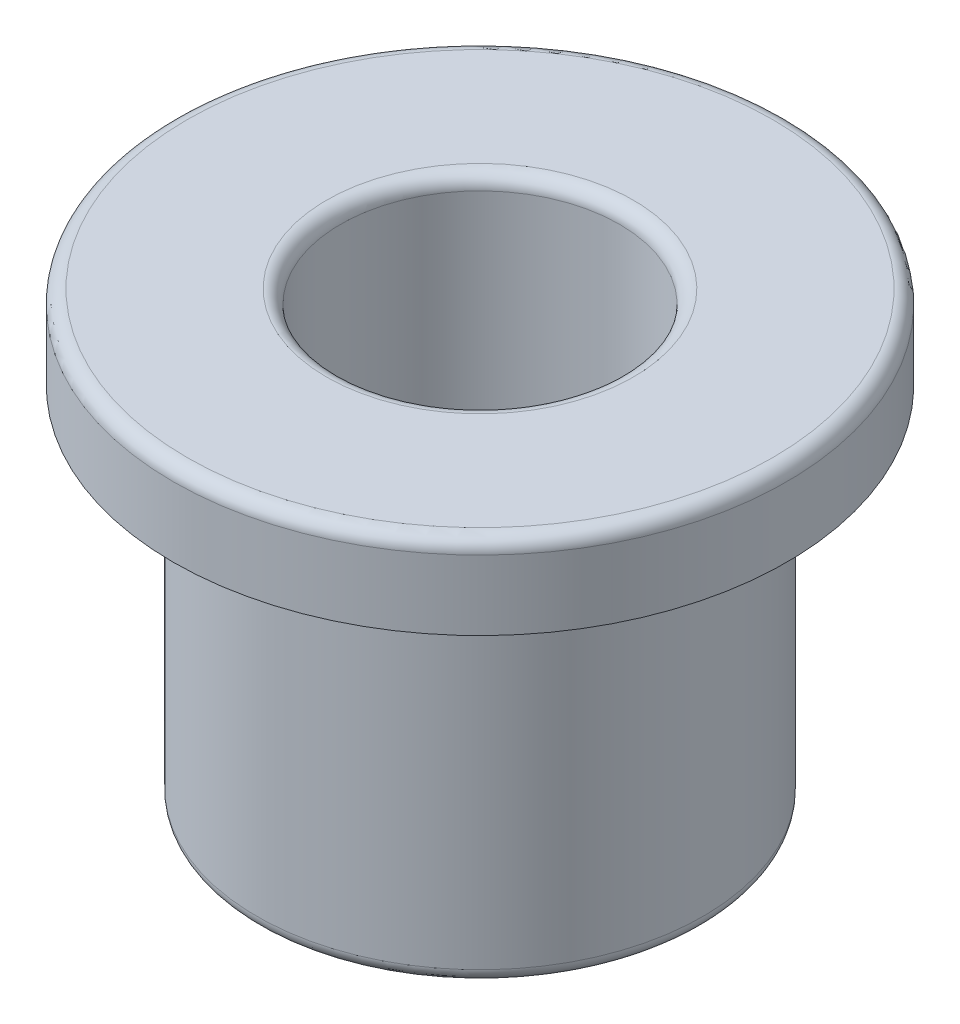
from build123d import *

# Parameters (mm, degrees)
CONG_1_R = 0.5


with BuildPart() as part:
    # Esquisse1 → R_volution1 (revolve)
    with BuildSketch(Plane.XY, mode=Mode.PRIVATE) as r_volution1_sk:
        Polygon((5, 0), (8, 0), (8, 13), (11, 13), (11, 16), (5, 16), align=None)
    revolve(r_volution1_sk.sketch.rotate(Axis((0, 0, 0), (0, 1, 0)), 90), axis=Axis((0, 0, 0), (0, 1, 0)))

    # Cong_1
    cong_1_edges = [part.edges().sort_by_distance(p)[0] for p in [
        (0, 0, 5),
        (0, 0, 8),
        (0, 13, 8),
        (0, 16, 11),
        (0, 16, 5),
    ]]
    fillet(cong_1_edges, radius=CONG_1_R)


solid = part.part
